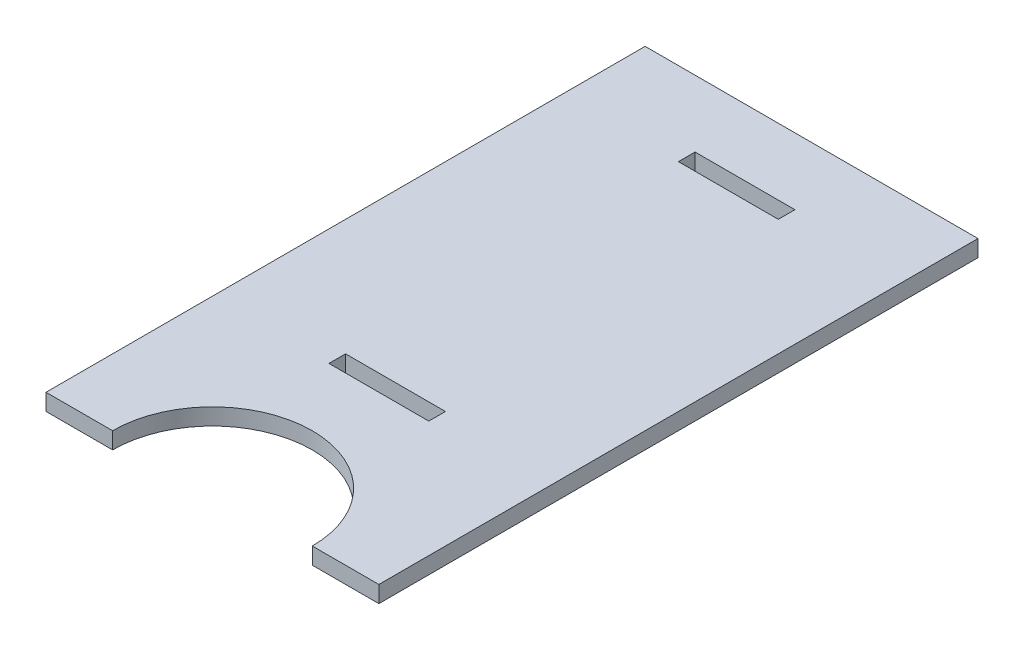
from build123d import *

# Parameters (mm, degrees)
CROQUIS1_W              = 30
CROQUIS1_H              = 5
SALIENTE_EXTRUIR1_DEPTH = 5


with BuildPart() as part:
    # Croquis1 → Saliente-Extruir1 (new body)
    with BuildSketch(Plane(origin=(0, 0, 0), x_dir=(1, 0, 0), z_dir=(0, 1, 0))):
        with BuildLine():
            Line((305.516384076, -130.906361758), (285.516384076, -130.906361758))
            Line((285.516384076, -130.906361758), (285.516384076, 49.093638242))
            Line((285.516384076, 49.093638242), (385.516384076, 49.093638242))
            Line((385.516384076, 49.093638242), (385.516384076, -130.906361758))
            Line((385.516384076, -130.906361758), (365.516384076, -130.906361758))
            ThreePointArc((365.516384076, -130.906361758), (335.516384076, -100.906361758), (305.516384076, -130.906361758))
        make_face()
        with Locations((335.516384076, -78.406361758)):
            Rectangle(CROQUIS1_W, CROQUIS1_H, mode=Mode.SUBTRACT)
        with Locations((335.516384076, 26.593638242)):
            Rectangle(CROQUIS1_W, CROQUIS1_H, mode=Mode.SUBTRACT)
    extrude(amount=SALIENTE_EXTRUIR1_DEPTH)


solid = part.part
